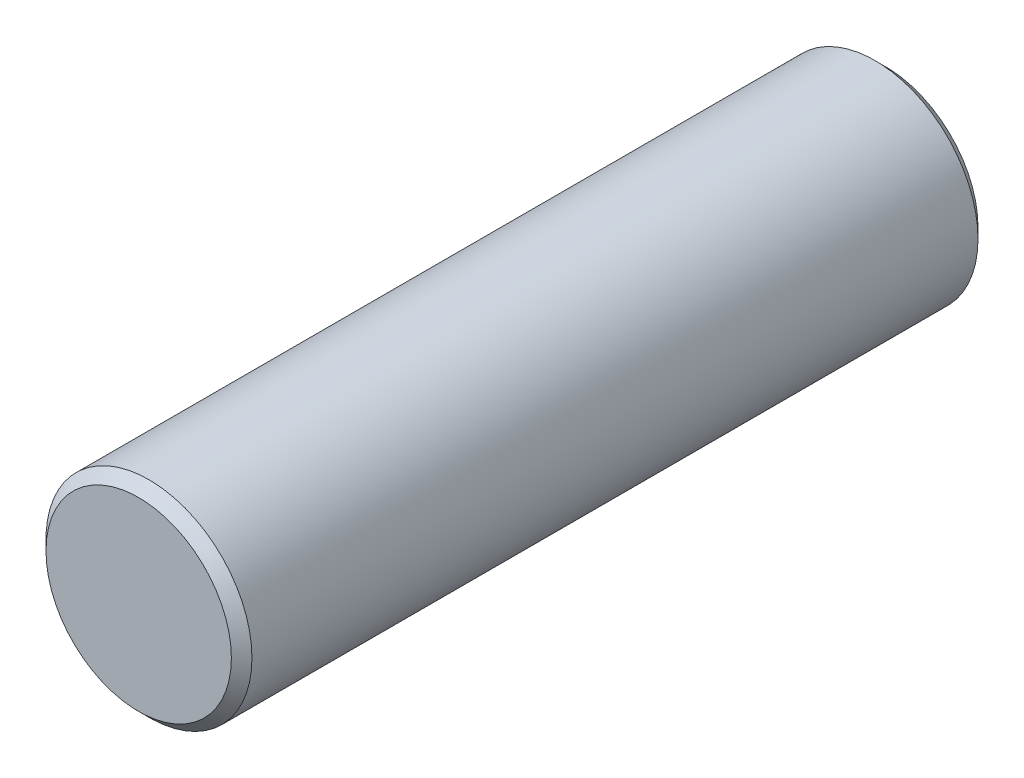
from build123d import *

# Parameters (mm, degrees)
ESQUISSE1_R        = 2
BOSS_EXTRU_1_DEPTH = 14.5
CHANFREIN1_SIZE    = 0.2


with BuildPart() as part:
    # Esquisse1 → Boss.-Extru.1 (new body)
    with BuildSketch(Plane.XY):
        with Locations((31.25, 56.075759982)):
            Circle(ESQUISSE1_R)
    extrude(amount=-BOSS_EXTRU_1_DEPTH)

    # Chanfrein1
    chanfrein1_edges = [part.edges().sort_by_distance(p)[0] for p in [
        (29.25, 56.075759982, 0),
        (29.25, 56.075759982, -14.5),
    ]]
    chamfer(chanfrein1_edges, length=CHANFREIN1_SIZE)


solid = part.part
